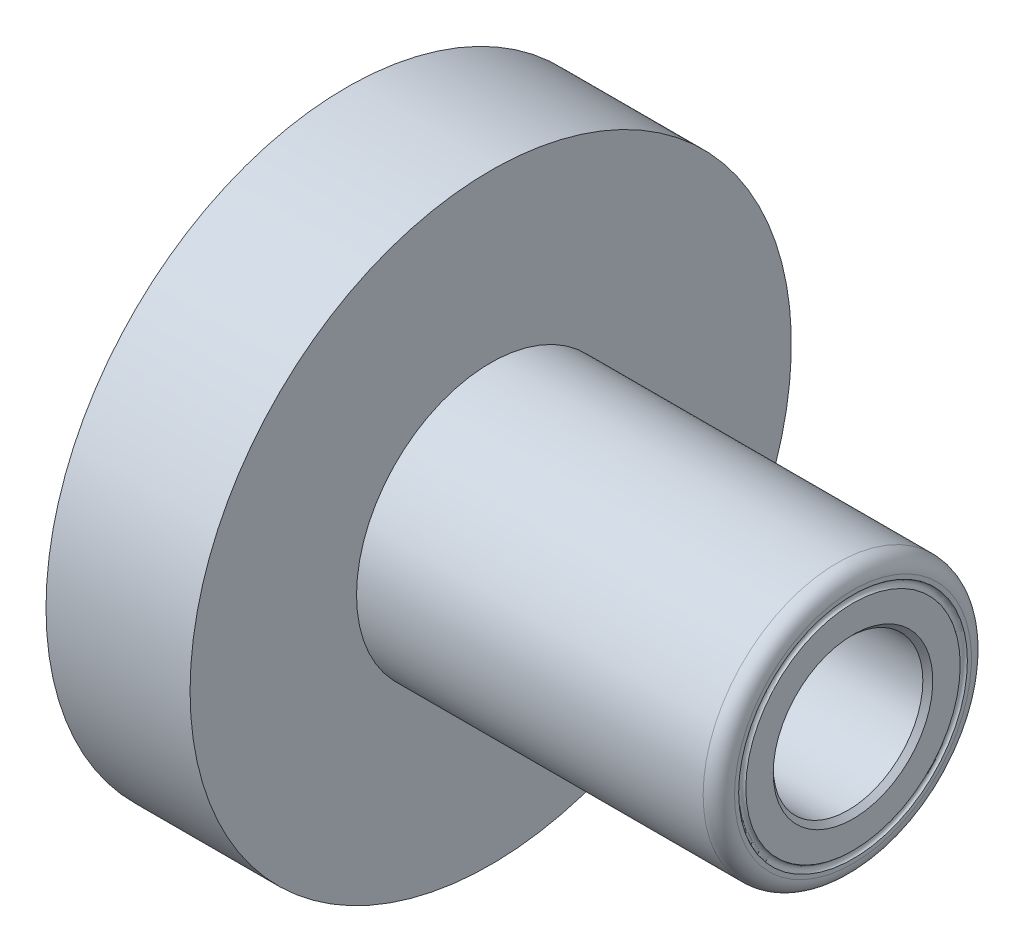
from build123d import *

# Parameters (mm, degrees)
SKETCH2_R          = 3.2004
CUT_EXTRUDE1_DEPTH = 7.9502
SKETCH3_R          = 7.505
CUT_EXTRUDE2_DEPTH = 67.33394917
CHAMFER1_SIZE      = 0.5
SKETCH4_R          = 0.381


with BuildPart() as part:
    # Sketch1 → Revolve1 (revolve)
    with BuildSketch(Plane.XY, mode=Mode.PRIVATE) as revolve1_sk:
        with BuildLine():
            Line((0, 9.906), (0, 30.1625))
            Line((0, 30.1625), (14.4526, 30.1625))
            Line((14.4526, 30.1625), (14.4526, 13.462))
            Line((14.4526, 13.462), (49.2252, 13.462))
            ThreePointArc((49.2252, 13.462), (50.338751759, 13.000751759), (50.8, 11.8872))
            Line((50.8, 11.8872), (50.8, 0))
            Line((50.8, 0), (30.9372, 0))
            Line((30.9372, 0), (30.9372, 9.906))
            Line((30.9372, 9.906), (0, 9.906))
        make_face()
    revolve(revolve1_sk.sketch.rotate(Axis((0, 0, 0), (1, 0, 0)), 90), axis=Axis((0, 0, 0), (1, 0, 0)))

    # Sketch2 → Cut-Extrude1 (cut)
    with BuildSketch(Plane.ZY):
        with Locations((-19.939, 0)):
            Circle(SKETCH2_R)
        with Locations(Location((19.939, 0, 0), (0, 0, 180))):
            Circle(SKETCH2_R)
    extrude(amount=-CUT_EXTRUDE1_DEPTH, mode=Mode.SUBTRACT)

    # Sketch3 → Cut-Extrude2 (cut, through all)
    with BuildSketch(Plane(origin=(50.8, 0, 0), x_dir=(0, 0, -1), z_dir=(1, 0, 0))):
        Circle(SKETCH3_R)
    extrude(amount=-CUT_EXTRUDE2_DEPTH, mode=Mode.SUBTRACT)

    # Chamfer1
    chamfer1_edges = [part.edges().sort_by_distance(p)[0] for p in [
        (50.8, 0, 7.505),
    ]]
    chamfer(chamfer1_edges, length=CHAMFER1_SIZE)

    # Sketch4 → Cut-Revolve1 (revolve, cut)
    with BuildSketch(Plane.XY, mode=Mode.PRIVATE) as cut_revolve1_sk:
        with Locations((50.927, 11.115)):
            Circle(SKETCH4_R)
    revolve(cut_revolve1_sk.sketch.rotate(Axis((0, 0, 0), (1, 0, 0)), 90), axis=Axis((0, 0, 0), (1, 0, 0)), mode=Mode.SUBTRACT)


solid = part.part
